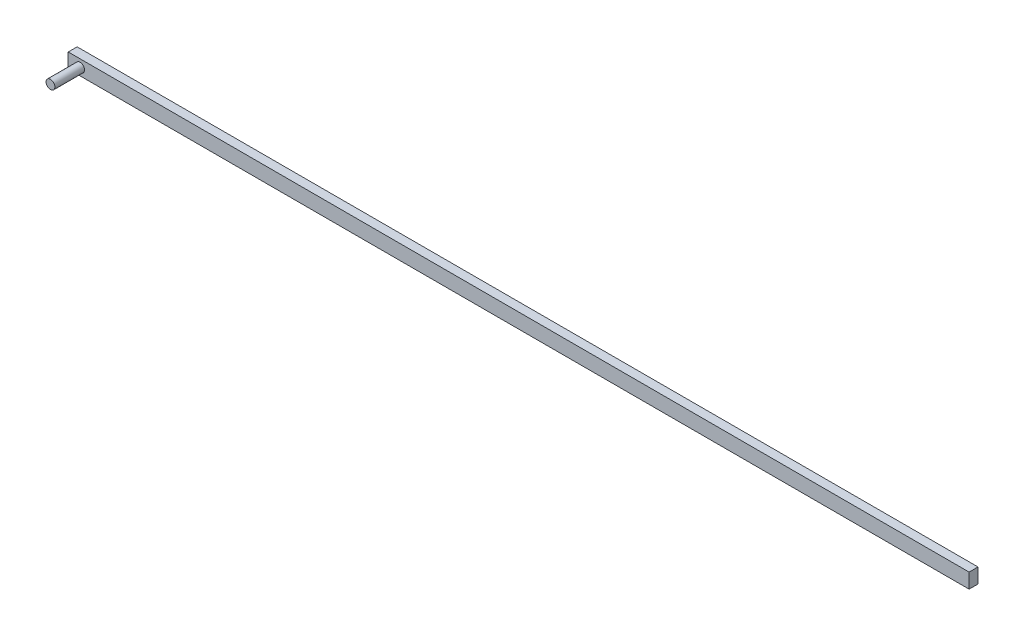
from build123d import *

# Parameters (mm, degrees)
ESQUISSE1_W        = 3040
ESQUISSE1_H        = 50
BOSS_EXTRU_1_DEPTH = 30
ESQUISSE5_R        = 15
BOSS_EXTRU_2_DEPTH = 100


with BuildPart() as part:
    # Esquisse1 → Boss.-Extru.1 (new body)
    with BuildSketch(Plane.XY):
        with Locations((1520, 25)):
            Rectangle(ESQUISSE1_W, ESQUISSE1_H)
    extrude(amount=BOSS_EXTRU_1_DEPTH)

    # Esquisse5 → Boss.-Extru.2 (add)
    with BuildSketch(Plane.XY.offset(30)):
        with Locations(Location((40, 25, 0), (0, 0, 180))):
            Circle(ESQUISSE5_R)
    extrude(amount=BOSS_EXTRU_2_DEPTH)


solid = part.part
